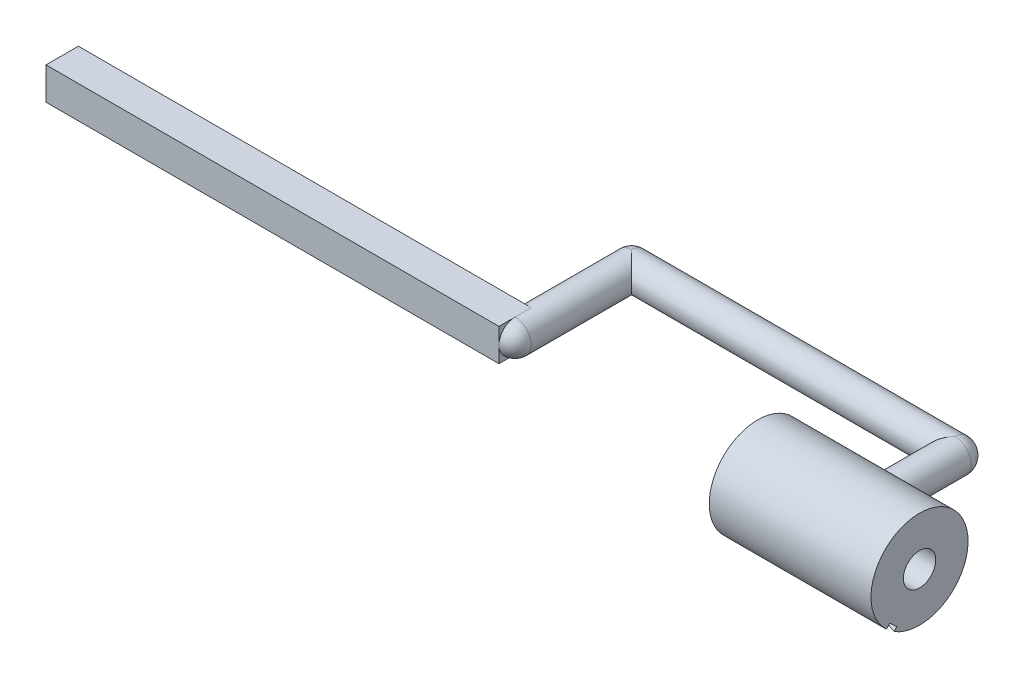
ISO-10303-21;
HEADER;
FILE_DESCRIPTION(('STEP AP214'),'2;1');
FILE_NAME('part.step','',(''),(''),'','','');
FILE_SCHEMA(('AUTOMOTIVE_DESIGN { 1 0 10303 214 1 1 1 1 }'));
ENDSEC;
DATA;
#1=APPLICATION_CONTEXT('core data for automotive mechanical design processes');
#2=APPLICATION_PROTOCOL_DEFINITION('international standard','automotive_design',2000,#1);
#3=PRODUCT_CONTEXT('',#1,'mechanical');
#4=PRODUCT('Part','Part','',(#3));
#5=PRODUCT_RELATED_PRODUCT_CATEGORY('part','',(#4));
#6=PRODUCT_DEFINITION_FORMATION('','',#4);
#7=PRODUCT_DEFINITION_CONTEXT('part definition',#1,'design');
#8=PRODUCT_DEFINITION('design','',#6,#7);
#9=PRODUCT_DEFINITION_SHAPE('','',#8);
#10=(LENGTH_UNIT() NAMED_UNIT(*) SI_UNIT(.MILLI.,.METRE.));
#11=(NAMED_UNIT(*) PLANE_ANGLE_UNIT() SI_UNIT($,.RADIAN.));
#12=(NAMED_UNIT(*) SI_UNIT($,.STERADIAN.) SOLID_ANGLE_UNIT());
#13=UNCERTAINTY_MEASURE_WITH_UNIT(LENGTH_MEASURE(1.E-05),#10,'distance_accuracy_value','');
#14=(GEOMETRIC_REPRESENTATION_CONTEXT(3) GLOBAL_UNCERTAINTY_ASSIGNED_CONTEXT((#13)) GLOBAL_UNIT_ASSIGNED_CONTEXT((#10,
#11,#12)) REPRESENTATION_CONTEXT('',''));
#15=CARTESIAN_POINT('',(0.,0.,0.));
#16=DIRECTION('',(0.,0.,1.));
#17=DIRECTION('',(1.,0.,0.));
#18=AXIS2_PLACEMENT_3D('',#15,#16,#17);
#19=CARTESIAN_POINT('',(12.5,0.,18.));
#20=DIRECTION('',(-1.,0.,0.));
#21=DIRECTION('',(0.,0.,1.));
#22=AXIS2_PLACEMENT_3D('',#19,#20,#21);
#23=CYLINDRICAL_SURFACE('',#22,7.5);
#24=CARTESIAN_POINT('',(-2.5,0.,10.5));
#25=CARTESIAN_POINT('',(-2.5000006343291,-0.136408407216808,10.4999996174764));
#26=CARTESIAN_POINT('',(-2.48879933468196,-0.272812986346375,10.5037557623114));
#27=CARTESIAN_POINT('',(-2.44442722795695,-0.541604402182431,10.518369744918));
#28=CARTESIAN_POINT('',(-2.41125414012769,-0.673990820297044,10.5292283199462));
#29=CARTESIAN_POINT('',(-2.32420189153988,-0.93083197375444,10.5568673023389));
#30=CARTESIAN_POINT('',(-2.27035734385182,-1.05529956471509,10.5736378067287));
#31=CARTESIAN_POINT('',(-2.14364706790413,-1.29343734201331,10.6113888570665));
#32=CARTESIAN_POINT('',(-2.0707775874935,-1.40710539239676,10.6323702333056));
#33=CARTESIAN_POINT('',(-1.90543548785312,-1.62435418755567,10.6771476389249));
#34=CARTESIAN_POINT('',(-1.81242191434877,-1.72750925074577,10.7010110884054));
#35=CARTESIAN_POINT('',(-1.61058211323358,-1.91708173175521,10.748492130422));
#36=CARTESIAN_POINT('',(-1.50175241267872,-2.00349546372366,10.7721096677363));
#37=CARTESIAN_POINT('',(-1.26753721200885,-2.15956235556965,10.8171666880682));
#38=CARTESIAN_POINT('',(-1.14176565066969,-2.22866214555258,10.8385240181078));
#39=CARTESIAN_POINT('',(-0.879559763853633,-2.3445471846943,10.875617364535));
#40=CARTESIAN_POINT('',(-0.74312870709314,-2.39133924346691,10.8913550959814));
#41=CARTESIAN_POINT('',(-0.468316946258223,-2.45968365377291,10.9147174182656));
#42=CARTESIAN_POINT('',(-0.330156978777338,-2.48203362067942,10.9225976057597));
#43=CARTESIAN_POINT('',(-0.0518406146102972,-2.50335280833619,10.9301085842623));
#44=CARTESIAN_POINT('',(0.0883151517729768,-2.5023292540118,10.9297419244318));
#45=CARTESIAN_POINT('',(0.359841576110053,-2.47754975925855,10.9210246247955));
#46=CARTESIAN_POINT('',(0.491321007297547,-2.45483478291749,10.9130396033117));
#47=CARTESIAN_POINT('',(0.748483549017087,-2.38901540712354,10.8905835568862));
#48=CARTESIAN_POINT('',(0.874165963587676,-2.34590856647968,10.8761117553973));
#49=CARTESIAN_POINT('',(1.1185318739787,-2.23984764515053,10.8420522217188));
#50=CARTESIAN_POINT('',(1.23707006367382,-2.17658512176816,10.8223858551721));
#51=CARTESIAN_POINT('',(1.46217727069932,-2.03222276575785,10.7801860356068));
#52=CARTESIAN_POINT('',(1.56874281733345,-1.95111778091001,10.7576517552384));
#53=CARTESIAN_POINT('',(1.77272899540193,-1.76837333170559,10.7108167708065));
#54=CARTESIAN_POINT('',(1.86938173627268,-1.66588287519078,10.6864852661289));
#55=CARTESIAN_POINT('',(2.0443281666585,-1.44584892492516,10.6398265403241));
#56=CARTESIAN_POINT('',(2.12262009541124,-1.32830398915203,10.6174995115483));
#57=CARTESIAN_POINT('',(2.25924075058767,-1.07986903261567,10.5770723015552));
#58=CARTESIAN_POINT('',(2.31736372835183,-0.94885819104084,10.559016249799));
#59=CARTESIAN_POINT('',(2.41050793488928,-0.678172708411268,10.5294858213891));
#60=CARTESIAN_POINT('',(2.44553718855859,-0.538501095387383,10.518009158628));
#61=CARTESIAN_POINT('',(2.4901391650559,-0.260959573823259,10.503309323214));
#62=CARTESIAN_POINT('',(2.50074952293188,-0.123273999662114,10.4997499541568));
#63=CARTESIAN_POINT('',(2.49916831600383,0.151937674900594,10.5002774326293));
#64=CARTESIAN_POINT('',(2.48698060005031,0.289463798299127,10.5043629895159));
#65=CARTESIAN_POINT('',(2.4409702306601,0.55629966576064,10.5194993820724));
#66=CARTESIAN_POINT('',(2.40778448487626,0.68573201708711,10.5303450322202));
#67=CARTESIAN_POINT('',(2.32151638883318,0.937139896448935,10.5577038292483));
#68=CARTESIAN_POINT('',(2.26843150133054,1.05911447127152,10.5742176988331));
#69=CARTESIAN_POINT('',(2.14232392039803,1.29572074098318,10.6117767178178));
#70=CARTESIAN_POINT('',(2.06881351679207,1.41007489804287,10.6329296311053));
#71=CARTESIAN_POINT('',(1.90451462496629,1.62516207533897,10.6773686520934));
#72=CARTESIAN_POINT('',(1.81372085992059,1.72589091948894,10.7006554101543));
#73=CARTESIAN_POINT('',(1.61255312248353,1.91563126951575,10.7480788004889));
#74=CARTESIAN_POINT('',(1.50147693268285,2.00390242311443,10.7722059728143));
#75=CARTESIAN_POINT('',(1.26557108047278,2.16064380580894,10.8175006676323));
#76=CARTESIAN_POINT('',(1.14074130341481,2.22911386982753,10.8386681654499));
#77=CARTESIAN_POINT('',(0.880817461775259,2.3439923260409,10.8754402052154));
#78=CARTESIAN_POINT('',(0.745744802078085,2.39044533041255,10.8910559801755));
#79=CARTESIAN_POINT('',(0.469053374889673,2.45973666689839,10.9147291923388));
#80=CARTESIAN_POINT('',(0.327437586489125,2.48258563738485,10.922790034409));
#81=CARTESIAN_POINT('',(0.0495072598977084,2.50319070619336,10.9300535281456));
#82=CARTESIAN_POINT('',(-0.0867058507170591,2.502175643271,10.9296899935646));
#83=CARTESIAN_POINT('',(-0.356912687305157,2.47810573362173,10.9212182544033));
#84=CARTESIAN_POINT('',(-0.490906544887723,2.45505219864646,10.913110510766));
#85=CARTESIAN_POINT('',(-0.750339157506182,2.38842953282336,10.8903868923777));
#86=CARTESIAN_POINT('',(-0.875892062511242,2.34525836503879,10.8758975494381));
#87=CARTESIAN_POINT('',(-1.11806851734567,2.23994841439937,10.8420900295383));
#88=CARTESIAN_POINT('',(-1.23469007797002,2.17780542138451,10.8227707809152));
#89=CARTESIAN_POINT('',(-1.46120917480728,2.03315173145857,10.7804292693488));
#90=CARTESIAN_POINT('',(-1.57059125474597,1.94987060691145,10.7572822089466));
#91=CARTESIAN_POINT('',(-1.7742245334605,1.76660720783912,10.7104160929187));
#92=CARTESIAN_POINT('',(-1.86847143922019,1.6666202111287,10.6866968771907));
#93=CARTESIAN_POINT('',(-2.04286103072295,1.44810389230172,10.6402492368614));
#94=CARTESIAN_POINT('',(-2.1223108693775,1.32900378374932,10.6175954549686));
#95=CARTESIAN_POINT('',(-2.25997607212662,1.07839339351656,10.5768502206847));
#96=CARTESIAN_POINT('',(-2.31819686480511,0.94688629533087,10.5587576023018));
#97=CARTESIAN_POINT('',(-2.40930408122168,0.681234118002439,10.5298621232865));
#98=CARTESIAN_POINT('',(-2.44320616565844,0.547469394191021,10.5187696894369));
#99=CARTESIAN_POINT('',(-2.48855070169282,0.275801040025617,10.5038398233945));
#100=CARTESIAN_POINT('',(-2.49999935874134,0.137898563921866,10.5000003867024));
#101=CARTESIAN_POINT('',(-2.5,0.,10.5));
#102=B_SPLINE_CURVE_WITH_KNOTS('',3,(#24,#25,#26,#27,#28,#29,#30,#31,#32,#33,#34,#35,#36,#37,
#38,#39,#40,#41,#42,#43,#44,#45,#46,#47,#48,#49,#50,#51,#52,#53,#54,#55,#56,#57,#58,#59,#60,#61,
#62,#63,#64,#65,#66,#67,#68,#69,#70,#71,#72,#73,#74,#75,#76,#77,#78,#79,#80,#81,#82,#83,#84,#85,
#86,#87,#88,#89,#90,#91,#92,#93,#94,#95,#96,#97,#98,#99,#100,#101),.UNSPECIFIED.,.T.,.F.,(4,2,2,
2,2,2,2,2,2,2,2,2,2,2,2,2,2,2,2,2,2,2,2,2,2,2,2,2,2,2,2,2,2,2,2,2,2,2,4),(0.,0.408717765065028,
0.817477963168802,1.22555668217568,1.63371594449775,2.0546171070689,2.47561083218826,
2.90870962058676,3.34167611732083,3.760048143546,4.17829084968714,4.57742066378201,
4.97659827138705,5.38220427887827,5.78792756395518,6.21483264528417,6.64177864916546,
7.07296014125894,7.50399172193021,7.91633957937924,8.32861782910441,8.72895394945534,
9.1293411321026,9.54025999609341,9.95130452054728,10.3810255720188,10.8107502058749,
11.2396003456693,11.668257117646,12.0748916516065,12.4815019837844,12.8803896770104,
13.2793659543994,13.6957516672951,14.1122552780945,14.5449915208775,14.9776170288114,
15.3909139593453,15.8040966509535),.UNSPECIFIED.);
#103=CARTESIAN_POINT('',(-2.5,0.,10.5));
#104=VERTEX_POINT('',#103);
#105=EDGE_CURVE('E145',#104,#104,#102,.T.);
#106=ORIENTED_EDGE('',*,*,#105,.T.);
#107=EDGE_LOOP('',(#106));
#108=FACE_BOUND('',#107,.T.);
#109=CARTESIAN_POINT('',(12.5,-5.48515276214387,23.1149877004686));
#110=CARTESIAN_POINT('',(9.67857142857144,-6.65261532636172,21.8630373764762));
#111=CARTESIAN_POINT('',(6.85714285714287,-7.16126186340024,20.228526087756));
#112=CARTESIAN_POINT('',(4.03571428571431,-7.66990840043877,18.5940147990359));
#113=CARTESIAN_POINT('',(1.21428571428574,-7.4189952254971,16.9006775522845));
#114=CARTESIAN_POINT('',(-1.60714285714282,-7.16808205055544,15.2073403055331));
#115=CARTESIAN_POINT('',(-4.42857142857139,-6.20730559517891,13.7905633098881));
#116=CARTESIAN_POINT('',(-7.24999999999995,-5.24652913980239,12.373786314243));
#117=CARTESIAN_POINT('',(-10.0714285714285,-3.76618296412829,11.5141796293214));
#118=CARTESIAN_POINT('',(-12.8928571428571,-2.28583678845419,10.6545729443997));
#119=CARTESIAN_POINT('',(-15.7142857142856,-0.579121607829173,10.5223922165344));
#120=CARTESIAN_POINT('',(-18.5357142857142,1.12759357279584,10.3902114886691));
#121=CARTESIAN_POINT('',(-21.3571428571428,2.72264188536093,11.011636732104));
#122=CARTESIAN_POINT('',(-24.1785714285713,4.31769019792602,11.6330619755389));
#123=CARTESIAN_POINT('',(-26.9999999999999,5.48515276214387,12.8850122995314));
#124=CARTESIAN_POINT('',(-29.8214285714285,6.65261532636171,14.1369626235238));
#125=CARTESIAN_POINT('',(-32.642857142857,7.16126186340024,15.771473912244));
#126=(BOUNDED_CURVE() B_SPLINE_CURVE(2,(#109,#110,#111,#112,#113,#114,#115,#116,#117,#118,#119,
#120,#121,#122,#123,#124,#125),.UNSPECIFIED.,.F.,.F.) B_SPLINE_CURVE_WITH_KNOTS((3,2,2,2,2,2,2,
2,3),(0.,0.125,0.25,0.375,0.5,0.625,0.75,0.875,1.),
.UNSPECIFIED.) CURVE() GEOMETRIC_REPRESENTATION_ITEM() RATIONAL_B_SPLINE_CURVE((1.,
0.974927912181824,1.,0.974927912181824,1.,0.974927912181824,1.,0.974927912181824,1.,
0.974927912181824,1.,0.974927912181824,1.,0.974927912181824,1.,0.974927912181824,1.)) REPRESENTATION_ITEM(''));
#127=CARTESIAN_POINT('',(12.5,-5.48515276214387,23.1149877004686));
#128=VERTEX_POINT('',#127);
#129=CARTESIAN_POINT('',(-12.5000173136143,-2.44928880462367,10.9112071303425));
#130=VERTEX_POINT('',#129);
#131=EDGE_CURVE('E52',#128,#130,#126,.T.);
#132=ORIENTED_EDGE('',*,*,#131,.F.);
#133=CARTESIAN_POINT('',(12.5,0.,18.));
#134=DIRECTION('',(1.,0.,0.));
#135=DIRECTION('',(0.,0.,-1.));
#136=AXIS2_PLACEMENT_3D('',#133,#134,#135);
#137=CIRCLE('',#136,7.5);
#138=CARTESIAN_POINT('',(12.5,-6.38825116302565,21.9294079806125));
#139=VERTEX_POINT('',#138);
#140=EDGE_CURVE('E135',#139,#128,#137,.T.);
#141=ORIENTED_EDGE('',*,*,#140,.F.);
#142=CARTESIAN_POINT('',(12.5,-6.38825116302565,21.9294079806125));
#143=CARTESIAN_POINT('',(9.67857142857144,-7.28511289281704,20.4713313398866));
#144=CARTESIAN_POINT('',(6.85714285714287,-7.46052164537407,18.7685159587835));
#145=CARTESIAN_POINT('',(4.03571428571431,-7.6359303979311,17.0657005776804));
#146=CARTESIAN_POINT('',(1.21428571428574,-7.05514431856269,15.4554099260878));
#147=CARTESIAN_POINT('',(-1.60714285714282,-6.47435823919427,13.8451192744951));
#148=CARTESIAN_POINT('',(-4.42857142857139,-5.25240913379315,12.6462911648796));
#149=CARTESIAN_POINT('',(-7.24999999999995,-4.03046002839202,11.4474630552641));
#150=CARTESIAN_POINT('',(-10.0714285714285,-2.40936990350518,10.897540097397));
#151=CARTESIAN_POINT('',(-12.8928571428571,-0.78827977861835,10.3476171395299));
#152=CARTESIAN_POINT('',(-15.7142857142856,0.91087458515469,10.5555183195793));
#153=CARTESIAN_POINT('',(-18.5357142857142,2.61002894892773,10.7634194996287));
#154=CARTESIAN_POINT('',(-21.3571428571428,4.050709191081,11.6879674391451));
#155=CARTESIAN_POINT('',(-24.1785714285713,5.49138943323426,12.6125153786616));
#156=CARTESIAN_POINT('',(-26.9999999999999,6.38825116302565,14.0705920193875));
#157=CARTESIAN_POINT('',(-29.8214285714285,7.28511289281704,15.5286686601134));
#158=CARTESIAN_POINT('',(-32.642857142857,7.46052164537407,17.2314840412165));
#159=(BOUNDED_CURVE() B_SPLINE_CURVE(2,(#142,#143,#144,#145,#146,#147,#148,#149,#150,#151,#152,
#153,#154,#155,#156,#157,#158),.UNSPECIFIED.,.F.,.F.) B_SPLINE_CURVE_WITH_KNOTS((3,2,2,2,2,2,2,
2,3),(0.,0.125,0.25,0.375,0.5,0.625,0.75,0.875,1.),
.UNSPECIFIED.) CURVE() GEOMETRIC_REPRESENTATION_ITEM() RATIONAL_B_SPLINE_CURVE((1.,
0.974927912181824,1.,0.974927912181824,1.,0.974927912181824,1.,0.974927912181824,1.,
0.974927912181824,1.,0.974927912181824,1.,0.974927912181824,1.,0.974927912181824,1.)) REPRESENTATION_ITEM(''));
#160=CARTESIAN_POINT('',(-12.5000000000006,-0.999303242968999,10.5668719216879));
#161=VERTEX_POINT('',#160);
#162=EDGE_CURVE('E138',#139,#161,#159,.T.);
#163=ORIENTED_EDGE('',*,*,#162,.T.);
#164=CARTESIAN_POINT('',(-12.5,0.,18.));
#165=DIRECTION('',(1.,0.,0.));
#166=DIRECTION('',(0.,0.,-1.));
#167=AXIS2_PLACEMENT_3D('',#164,#165,#166);
#168=CIRCLE('',#167,7.5);
#169=EDGE_CURVE('E137',#161,#130,#168,.T.);
#170=ORIENTED_EDGE('',*,*,#169,.T.);
#171=EDGE_LOOP('',(#132,#141,#163,#170));
#172=FACE_BOUND('',#171,.T.);
#173=ADVANCED_FACE('F32',(#108,#172),#23,.T.);
#174=CARTESIAN_POINT('',(-12.5,0.,18.));
#175=DIRECTION('',(1.,0.,0.));
#176=DIRECTION('',(0.,0.,-1.));
#177=AXIS2_PLACEMENT_3D('',#174,#175,#176);
#178=PLANE('',#177);
#179=CARTESIAN_POINT('',(-12.5,0.,18.));
#180=DIRECTION('',(1.,0.,0.));
#181=DIRECTION('',(0.,0.,-1.));
#182=AXIS2_PLACEMENT_3D('',#179,#180,#181);
#183=CIRCLE('',#182,2.5);
#184=CARTESIAN_POINT('',(-12.5,0.,15.5));
#185=VERTEX_POINT('',#184);
#186=EDGE_CURVE('E177',#185,#185,#183,.F.);
#187=ORIENTED_EDGE('',*,*,#186,.F.);
#188=EDGE_LOOP('',(#187));
#189=FACE_BOUND('',#188,.T.);
#190=CARTESIAN_POINT('',(-12.5,-0.799127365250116,11.1462123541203));
#191=CARTESIAN_POINT('',(-12.5,-0.816237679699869,11.0966924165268));
#192=CARTESIAN_POINT('',(-12.5,-0.833347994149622,11.0471724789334));
#193=CARTESIAN_POINT('',(-12.5,-0.867568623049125,10.9481326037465));
#194=CARTESIAN_POINT('',(-12.5,-0.884678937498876,10.898612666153));
#195=CARTESIAN_POINT('',(-12.5,-0.934293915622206,10.755019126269));
#196=CARTESIAN_POINT('',(-12.5,-0.966798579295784,10.6609455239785));
#197=CARTESIAN_POINT('',(-12.5,-0.999303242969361,10.566871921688));
#198=B_SPLINE_CURVE_WITH_KNOTS('',3,(#190,#191,#192,#193,#194,#195,#196,#197),.UNSPECIFIED.,.F.,
.F.,(4,2,2,4),(0.,0.157177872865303,0.314355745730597,0.612948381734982),.UNSPECIFIED.);
#199=CARTESIAN_POINT('',(-12.5,-0.799127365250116,11.1462123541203));
#200=VERTEX_POINT('',#199);
#201=EDGE_CURVE('E11',#200,#161,#198,.T.);
#202=ORIENTED_EDGE('',*,*,#201,.F.);
#203=CARTESIAN_POINT('',(-12.5,-2.20080480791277,11.6305251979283));
#204=CARTESIAN_POINT('',(-12.5,-2.08099445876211,11.5891278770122));
#205=CARTESIAN_POINT('',(-12.5,-1.96118410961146,11.5477305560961));
#206=CARTESIAN_POINT('',(-12.5,-1.72156341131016,11.4649359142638));
#207=CARTESIAN_POINT('',(-12.5,-1.6017530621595,11.4235385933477));
#208=CARTESIAN_POINT('',(-12.5,-1.25433759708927,11.3034982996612));
#209=CARTESIAN_POINT('',(-12.5,-1.0267324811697,11.2248553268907));
#210=CARTESIAN_POINT('',(-12.5,-0.79912736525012,11.1462123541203));
#211=B_SPLINE_CURVE_WITH_KNOTS('',3,(#203,#204,#205,#206,#207,#208,#209,#210),.UNSPECIFIED.,.F.,
.F.,(4,2,2,4),(0.,0.380281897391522,0.760563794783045,1.48298974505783),.UNSPECIFIED.);
#212=CARTESIAN_POINT('',(-12.5,-2.20080480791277,11.6305251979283));
#213=VERTEX_POINT('',#212);
#214=EDGE_CURVE('E44',#213,#200,#211,.T.);
#215=ORIENTED_EDGE('',*,*,#214,.F.);
#216=CARTESIAN_POINT('',(-12.5,-2.44934015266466,10.9112248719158));
#217=CARTESIAN_POINT('',(-12.5,-2.42809624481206,10.9727080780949));
#218=CARTESIAN_POINT('',(-12.5,-2.40685233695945,11.0341912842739));
#219=CARTESIAN_POINT('',(-12.5,-2.36436452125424,11.157157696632));
#220=CARTESIAN_POINT('',(-12.5,-2.34312061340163,11.218640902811));
#221=CARTESIAN_POINT('',(-12.5,-2.28151940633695,11.3969244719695));
#222=CARTESIAN_POINT('',(-12.5,-2.24116210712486,11.5137248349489));
#223=CARTESIAN_POINT('',(-12.5,-2.20080480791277,11.6305251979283));
#224=B_SPLINE_CURVE_WITH_KNOTS('',3,(#216,#217,#218,#219,#220,#221,#222,#223),.UNSPECIFIED.,.F.,
.F.,(4,2,2,4),(0.,0.195149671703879,0.390299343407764,0.761027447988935),.UNSPECIFIED.);
#225=EDGE_CURVE('E263',#130,#213,#224,.T.);
#226=ORIENTED_EDGE('',*,*,#225,.F.);
#227=ORIENTED_EDGE('',*,*,#169,.F.);
#228=EDGE_LOOP('',(#202,#215,#226,#227));
#229=FACE_BOUND('',#228,.T.);
#230=ADVANCED_FACE('F237',(#189,#229),#178,.F.);
#231=CARTESIAN_POINT('',(-50.,-2.5,15.5));
#232=DIRECTION('',(-1.,0.,0.));
#233=DIRECTION('',(0.,0.,1.));
#234=AXIS2_PLACEMENT_3D('',#231,#232,#233);
#235=PLANE('',#234);
#236=CARTESIAN_POINT('',(-50.,0.,18.));
#237=DIRECTION('',(-1.,0.,0.));
#238=DIRECTION('',(0.,0.,1.));
#239=AXIS2_PLACEMENT_3D('',#236,#237,#238);
#240=CIRCLE('',#239,2.5);
#241=CARTESIAN_POINT('',(-50.,0.,20.5));
#242=VERTEX_POINT('',#241);
#243=CARTESIAN_POINT('',(-50.,-2.5,18.));
#244=VERTEX_POINT('',#243);
#245=EDGE_CURVE('E351',#242,#244,#240,.F.);
#246=ORIENTED_EDGE('',*,*,#245,.F.);
#247=DIRECTION('',(0.,1.,0.));
#248=VECTOR('',#247,1.);
#249=CARTESIAN_POINT('',(-50.,2.5,20.5));
#250=LINE('',#249,#248);
#251=CARTESIAN_POINT('',(-50.,-2.5,20.5));
#252=VERTEX_POINT('',#251);
#253=EDGE_CURVE('E185',#252,#242,#250,.T.);
#254=ORIENTED_EDGE('',*,*,#253,.F.);
#255=DIRECTION('',(0.,0.,1.));
#256=VECTOR('',#255,1.);
#257=CARTESIAN_POINT('',(-50.,-2.5,15.5));
#258=LINE('',#257,#256);
#259=EDGE_CURVE('E180',#244,#252,#258,.T.);
#260=ORIENTED_EDGE('',*,*,#259,.F.);
#261=EDGE_LOOP('',(#246,#254,#260));
#262=FACE_BOUND('',#261,.T.);
#263=ADVANCED_FACE('F245',(#262),#235,.F.);
#264=CARTESIAN_POINT('',(-50.,2.5,18.));
#265=VERTEX_POINT('',#264);
#266=EDGE_CURVE('E349',#265,#242,#240,.F.);
#267=ORIENTED_EDGE('',*,*,#266,.F.);
#268=DIRECTION('',(0.,0.,-1.));
#269=VECTOR('',#268,1.);
#270=CARTESIAN_POINT('',(-50.,2.5,15.5));
#271=LINE('',#270,#269);
#272=CARTESIAN_POINT('',(-50.,2.5,20.5));
#273=VERTEX_POINT('',#272);
#274=EDGE_CURVE('E188',#273,#265,#271,.T.);
#275=ORIENTED_EDGE('',*,*,#274,.F.);
#276=EDGE_CURVE('E184',#242,#273,#250,.T.);
#277=ORIENTED_EDGE('',*,*,#276,.F.);
#278=EDGE_LOOP('',(#267,#275,#277));
#279=FACE_BOUND('',#278,.T.);
#280=ADVANCED_FACE('F314',(#279),#235,.F.);
#281=CARTESIAN_POINT('',(-50.,0.,18.));
#282=DIRECTION('',(0.,0.,-1.));
#283=DIRECTION('',(-1.,0.,0.));
#284=AXIS2_PLACEMENT_3D('',#281,#282,#283);
#285=CYLINDRICAL_SURFACE('',#284,2.5);
#286=CARTESIAN_POINT('',(-50.,0.,0.));
#287=DIRECTION('',(0.707106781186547,0.,-0.707106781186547));
#288=DIRECTION('',(0.707106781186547,0.,0.707106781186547));
#289=AXIS2_PLACEMENT_3D('',#286,#287,#288);
#290=ELLIPSE('',#289,3.53553390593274,2.5);
#291=CARTESIAN_POINT('',(-50.,2.5,0.));
#292=VERTEX_POINT('',#291);
#293=CARTESIAN_POINT('',(-50.,-2.5,0.));
#294=VERTEX_POINT('',#293);
#295=EDGE_CURVE('E217',#292,#294,#290,.T.);
#296=ORIENTED_EDGE('',*,*,#295,.F.);
#297=CARTESIAN_POINT('',(-50.,0.,0.));
#298=DIRECTION('',(0.,0.,1.));
#299=DIRECTION('',(1.,0.,0.));
#300=AXIS2_PLACEMENT_3D('',#297,#298,#299);
#301=CIRCLE('',#300,2.5);
#302=EDGE_CURVE('E211',#292,#294,#301,.T.);
#303=ORIENTED_EDGE('',*,*,#302,.T.);
#304=EDGE_LOOP('',(#296,#303));
#305=FACE_BOUND('',#304,.T.);
#306=CARTESIAN_POINT('',(-50.,2.5,15.5));
#307=VERTEX_POINT('',#306);
#308=EDGE_CURVE('E187',#265,#307,#271,.T.);
#309=ORIENTED_EDGE('',*,*,#308,.F.);
#310=CARTESIAN_POINT('',(-50.,0.,18.));
#311=DIRECTION('',(0.,0.,1.));
#312=DIRECTION('',(1.,0.,0.));
#313=AXIS2_PLACEMENT_3D('',#310,#311,#312);
#314=CIRCLE('',#313,2.5);
#315=EDGE_CURVE('E214',#244,#265,#314,.T.);
#316=ORIENTED_EDGE('',*,*,#315,.F.);
#317=CARTESIAN_POINT('',(-50.,-2.5,15.5));
#318=VERTEX_POINT('',#317);
#319=EDGE_CURVE('E60',#318,#244,#258,.T.);
#320=ORIENTED_EDGE('',*,*,#319,.F.);
#321=CARTESIAN_POINT('',(-50.,0.,15.5));
#322=DIRECTION('',(0.,0.,1.));
#323=DIRECTION('',(1.,0.,0.));
#324=AXIS2_PLACEMENT_3D('',#321,#322,#323);
#325=CIRCLE('',#324,2.5);
#326=EDGE_CURVE('E232',#307,#318,#325,.T.);
#327=ORIENTED_EDGE('',*,*,#326,.F.);
#328=EDGE_LOOP('',(#309,#316,#320,#327));
#329=FACE_BOUND('',#328,.T.);
#330=ADVANCED_FACE('F332',(#305,#329),#285,.T.);
#331=CARTESIAN_POINT('',(-50.,0.,0.));
#332=DIRECTION('',(1.,0.,0.));
#333=DIRECTION('',(0.,0.,-1.));
#334=AXIS2_PLACEMENT_3D('',#331,#332,#333);
#335=CYLINDRICAL_SURFACE('',#334,2.5);
#336=CARTESIAN_POINT('',(0.,0.,0.));
#337=DIRECTION('',(-0.707106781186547,0.,-0.707106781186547));
#338=DIRECTION('',(0.707106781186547,0.,-0.707106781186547));
#339=AXIS2_PLACEMENT_3D('',#336,#337,#338);
#340=ELLIPSE('',#339,3.53553390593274,2.5);
#341=CARTESIAN_POINT('',(0.,2.5,0.));
#342=VERTEX_POINT('',#341);
#343=CARTESIAN_POINT('',(0.,-2.5,0.));
#344=VERTEX_POINT('',#343);
#345=EDGE_CURVE('E147',#342,#344,#340,.F.);
#346=ORIENTED_EDGE('',*,*,#345,.F.);
#347=CARTESIAN_POINT('',(0.,0.,0.));
#348=DIRECTION('',(1.,0.,0.));
#349=DIRECTION('',(0.,0.,-1.));
#350=AXIS2_PLACEMENT_3D('',#347,#348,#349);
#351=CIRCLE('',#350,2.5);
#352=EDGE_CURVE('E220',#344,#342,#351,.T.);
#353=ORIENTED_EDGE('',*,*,#352,.F.);
#354=EDGE_LOOP('',(#346,#353));
#355=FACE_BOUND('',#354,.T.);
#356=CARTESIAN_POINT('',(-50.,0.,0.));
#357=DIRECTION('',(1.,0.,0.));
#358=DIRECTION('',(0.,0.,-1.));
#359=AXIS2_PLACEMENT_3D('',#356,#357,#358);
#360=CIRCLE('',#359,2.5);
#361=EDGE_CURVE('E223',#294,#292,#360,.T.);
#362=ORIENTED_EDGE('',*,*,#361,.T.);
#363=ORIENTED_EDGE('',*,*,#295,.T.);
#364=EDGE_LOOP('',(#362,#363));
#365=FACE_BOUND('',#364,.T.);
#366=ADVANCED_FACE('F247',(#355,#365),#335,.T.);
#367=CARTESIAN_POINT('',(0.,0.,18.));
#368=DIRECTION('',(0.,0.,-1.));
#369=DIRECTION('',(-1.,0.,0.));
#370=AXIS2_PLACEMENT_3D('',#367,#368,#369);
#371=CYLINDRICAL_SURFACE('',#370,2.5);
#372=CARTESIAN_POINT('',(0.,0.,0.));
#373=DIRECTION('',(0.,0.,1.));
#374=DIRECTION('',(1.,0.,0.));
#375=AXIS2_PLACEMENT_3D('',#372,#373,#374);
#376=CIRCLE('',#375,2.5);
#377=EDGE_CURVE('E143',#344,#342,#376,.T.);
#378=ORIENTED_EDGE('',*,*,#377,.T.);
#379=ORIENTED_EDGE('',*,*,#345,.T.);
#380=EDGE_LOOP('',(#378,#379));
#381=FACE_BOUND('',#380,.T.);
#382=ORIENTED_EDGE('',*,*,#105,.F.);
#383=EDGE_LOOP('',(#382));
#384=FACE_BOUND('',#383,.T.);
#385=ADVANCED_FACE('F34',(#381,#384),#371,.T.);
#386=CARTESIAN_POINT('',(12.5,0.,18.));
#387=DIRECTION('',(1.,0.,0.));
#388=DIRECTION('',(0.,0.,-1.));
#389=AXIS2_PLACEMENT_3D('',#386,#387,#388);
#390=PLANE('',#389);
#391=DIRECTION('',(0.,-0.731353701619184,0.681998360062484));
#392=VECTOR('',#391,1.);
#393=CARTESIAN_POINT('',(12.5,-5.48515276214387,23.1149877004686));
#394=LINE('',#393,#392);
#395=CARTESIAN_POINT('',(12.5,-4.92857252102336,22.5959682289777));
#396=VERTEX_POINT('',#395);
#397=EDGE_CURVE('E122',#396,#128,#394,.T.);
#398=ORIENTED_EDGE('',*,*,#397,.F.);
#399=DIRECTION('',(0.,0.681998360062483,0.731353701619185));
#400=VECTOR('',#399,1.);
#401=CARTESIAN_POINT('',(12.5,-4.92857252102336,22.5959682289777));
#402=LINE('',#401,#400);
#403=CARTESIAN_POINT('',(12.5,-5.93996909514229,21.5113781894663));
#404=VERTEX_POINT('',#403);
#405=EDGE_CURVE('E129',#404,#396,#402,.T.);
#406=ORIENTED_EDGE('',*,*,#405,.F.);
#407=DIRECTION('',(0.,0.731353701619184,-0.681998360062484));
#408=VECTOR('',#407,1.);
#409=CARTESIAN_POINT('',(12.5,-5.93996909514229,21.5113781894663));
#410=LINE('',#409,#408);
#411=EDGE_CURVE('E142',#139,#404,#410,.T.);
#412=ORIENTED_EDGE('',*,*,#411,.F.);
#413=ORIENTED_EDGE('',*,*,#140,.T.);
#414=EDGE_LOOP('',(#398,#406,#412,#413));
#415=FACE_BOUND('',#414,.T.);
#416=CARTESIAN_POINT('',(12.5,0.,18.));
#417=DIRECTION('',(1.,0.,0.));
#418=DIRECTION('',(0.,0.,-1.));
#419=AXIS2_PLACEMENT_3D('',#416,#417,#418);
#420=CIRCLE('',#419,2.5);
#421=CARTESIAN_POINT('',(12.5,0.,15.5));
#422=VERTEX_POINT('',#421);
#423=EDGE_CURVE('E169',#422,#422,#420,.T.);
#424=ORIENTED_EDGE('',*,*,#423,.F.);
#425=EDGE_LOOP('',(#424));
#426=FACE_BOUND('',#425,.T.);
#427=ADVANCED_FACE('F140',(#415,#426),#390,.T.);
#428=CARTESIAN_POINT('',(-120.,2.5,15.5));
#429=DIRECTION('',(0.,0.,1.));
#430=DIRECTION('',(1.,0.,0.));
#431=AXIS2_PLACEMENT_3D('',#428,#429,#430);
#432=PLANE('',#431);
#433=DIRECTION('',(1.,0.,0.));
#434=VECTOR('',#433,1.);
#435=CARTESIAN_POINT('',(-120.,2.5,15.5));
#436=LINE('',#435,#434);
#437=CARTESIAN_POINT('',(-120.,2.5,15.5));
#438=VERTEX_POINT('',#437);
#439=EDGE_CURVE('E200',#438,#307,#436,.T.);
#440=ORIENTED_EDGE('',*,*,#439,.T.);
#441=ORIENTED_EDGE('',*,*,#326,.T.);
#442=DIRECTION('',(1.,0.,0.));
#443=VECTOR('',#442,1.);
#444=CARTESIAN_POINT('',(-120.,-2.5,15.5));
#445=LINE('',#444,#443);
#446=CARTESIAN_POINT('',(-120.,-2.5,15.5));
#447=VERTEX_POINT('',#446);
#448=EDGE_CURVE('E209',#447,#318,#445,.T.);
#449=ORIENTED_EDGE('',*,*,#448,.F.);
#450=DIRECTION('',(0.,-1.,0.));
#451=VECTOR('',#450,1.);
#452=CARTESIAN_POINT('',(-120.,2.5,15.5));
#453=LINE('',#452,#451);
#454=EDGE_CURVE('E191',#438,#447,#453,.T.);
#455=ORIENTED_EDGE('',*,*,#454,.F.);
#456=EDGE_LOOP('',(#440,#441,#449,#455));
#457=FACE_BOUND('',#456,.T.);
#458=ADVANCED_FACE('F241',(#457),#432,.F.);
#459=CARTESIAN_POINT('',(-120.,-2.5,15.5));
#460=DIRECTION('',(0.,1.,0.));
#461=DIRECTION('',(0.,0.,1.));
#462=AXIS2_PLACEMENT_3D('',#459,#460,#461);
#463=PLANE('',#462);
#464=ORIENTED_EDGE('',*,*,#319,.T.);
#465=ORIENTED_EDGE('',*,*,#259,.T.);
#466=DIRECTION('',(1.,0.,0.));
#467=VECTOR('',#466,1.);
#468=CARTESIAN_POINT('',(-120.,-2.5,20.5));
#469=LINE('',#468,#467);
#470=CARTESIAN_POINT('',(-120.,-2.5,20.5));
#471=VERTEX_POINT('',#470);
#472=EDGE_CURVE('E206',#471,#252,#469,.T.);
#473=ORIENTED_EDGE('',*,*,#472,.F.);
#474=DIRECTION('',(0.,0.,1.));
#475=VECTOR('',#474,1.);
#476=CARTESIAN_POINT('',(-120.,-2.5,15.5));
#477=LINE('',#476,#475);
#478=EDGE_CURVE('E194',#447,#471,#477,.T.);
#479=ORIENTED_EDGE('',*,*,#478,.F.);
#480=ORIENTED_EDGE('',*,*,#448,.T.);
#481=EDGE_LOOP('',(#464,#465,#473,#479,#480));
#482=FACE_BOUND('',#481,.T.);
#483=ADVANCED_FACE('F326',(#482),#463,.F.);
#484=CARTESIAN_POINT('',(-120.,2.5,20.5));
#485=DIRECTION('',(0.,0.,-1.));
#486=DIRECTION('',(0.,1.,0.));
#487=AXIS2_PLACEMENT_3D('',#484,#485,#486);
#488=PLANE('',#487);
#489=ORIENTED_EDGE('',*,*,#253,.T.);
#490=ORIENTED_EDGE('',*,*,#276,.T.);
#491=DIRECTION('',(1.,0.,0.));
#492=VECTOR('',#491,1.);
#493=CARTESIAN_POINT('',(-120.,2.5,20.5));
#494=LINE('',#493,#492);
#495=CARTESIAN_POINT('',(-120.,2.5,20.5));
#496=VERTEX_POINT('',#495);
#497=EDGE_CURVE('E203',#496,#273,#494,.T.);
#498=ORIENTED_EDGE('',*,*,#497,.F.);
#499=DIRECTION('',(0.,1.,0.));
#500=VECTOR('',#499,1.);
#501=CARTESIAN_POINT('',(-120.,2.5,20.5));
#502=LINE('',#501,#500);
#503=EDGE_CURVE('E196',#471,#496,#502,.T.);
#504=ORIENTED_EDGE('',*,*,#503,.F.);
#505=ORIENTED_EDGE('',*,*,#472,.T.);
#506=EDGE_LOOP('',(#489,#490,#498,#504,#505));
#507=FACE_BOUND('',#506,.T.);
#508=ADVANCED_FACE('F322',(#507),#488,.F.);
#509=CARTESIAN_POINT('',(-120.,2.5,15.5));
#510=DIRECTION('',(0.,-1.,0.));
#511=DIRECTION('',(0.,0.,-1.));
#512=AXIS2_PLACEMENT_3D('',#509,#510,#511);
#513=PLANE('',#512);
#514=ORIENTED_EDGE('',*,*,#274,.T.);
#515=ORIENTED_EDGE('',*,*,#308,.T.);
#516=ORIENTED_EDGE('',*,*,#439,.F.);
#517=DIRECTION('',(0.,0.,-1.));
#518=VECTOR('',#517,1.);
#519=CARTESIAN_POINT('',(-120.,2.5,15.5));
#520=LINE('',#519,#518);
#521=EDGE_CURVE('E198',#496,#438,#520,.T.);
#522=ORIENTED_EDGE('',*,*,#521,.F.);
#523=ORIENTED_EDGE('',*,*,#497,.T.);
#524=EDGE_LOOP('',(#514,#515,#516,#522,#523));
#525=FACE_BOUND('',#524,.T.);
#526=ADVANCED_FACE('F318',(#525),#513,.F.);
#527=CARTESIAN_POINT('',(-120.,-2.5,15.5));
#528=DIRECTION('',(-1.,0.,0.));
#529=DIRECTION('',(0.,0.,1.));
#530=AXIS2_PLACEMENT_3D('',#527,#528,#529);
#531=PLANE('',#530);
#532=ORIENTED_EDGE('',*,*,#454,.T.);
#533=ORIENTED_EDGE('',*,*,#478,.T.);
#534=ORIENTED_EDGE('',*,*,#503,.T.);
#535=ORIENTED_EDGE('',*,*,#521,.T.);
#536=EDGE_LOOP('',(#532,#533,#534,#535));
#537=FACE_BOUND('',#536,.T.);
#538=ADVANCED_FACE('F310',(#537),#531,.T.);
#539=CARTESIAN_POINT('',(-120.001,0.,18.));
#540=DIRECTION('',(1.,0.,0.));
#541=DIRECTION('',(0.,0.,-1.));
#542=AXIS2_PLACEMENT_3D('',#539,#540,#541);
#543=CYLINDRICAL_SURFACE('',#542,2.5);
#544=ORIENTED_EDGE('',*,*,#423,.T.);
#545=EDGE_LOOP('',(#544));
#546=FACE_BOUND('',#545,.T.);
#547=ORIENTED_EDGE('',*,*,#186,.T.);
#548=EDGE_LOOP('',(#547));
#549=FACE_BOUND('',#548,.T.);
#550=ADVANCED_FACE('F306',(#546,#549),#543,.F.);
#551=CARTESIAN_POINT('',(-50.,0.,18.));
#552=DIRECTION('',(0.,1.,0.));
#553=DIRECTION('',(1.,0.,0.));
#554=AXIS2_PLACEMENT_3D('',#551,#552,#553);
#555=SPHERICAL_SURFACE('',#554,2.5);
#556=ORIENTED_EDGE('',*,*,#315,.T.);
#557=ORIENTED_EDGE('',*,*,#266,.T.);
#558=ORIENTED_EDGE('',*,*,#245,.T.);
#559=EDGE_LOOP('',(#556,#557,#558));
#560=FACE_BOUND('',#559,.T.);
#561=ADVANCED_FACE('F302',(#560),#555,.T.);
#562=CARTESIAN_POINT('',(-50.,0.,0.));
#563=DIRECTION('',(0.,-1.,0.));
#564=DIRECTION('',(0.,0.,-1.));
#565=AXIS2_PLACEMENT_3D('',#562,#563,#564);
#566=SPHERICAL_SURFACE('',#565,2.5);
#567=ORIENTED_EDGE('',*,*,#302,.F.);
#568=ORIENTED_EDGE('',*,*,#361,.F.);
#569=EDGE_LOOP('',(#567,#568));
#570=FACE_BOUND('',#569,.T.);
#571=ADVANCED_FACE('F298',(#570),#566,.T.);
#572=CARTESIAN_POINT('',(0.,0.,0.));
#573=DIRECTION('',(0.,-1.,0.));
#574=DIRECTION('',(0.,0.,1.));
#575=AXIS2_PLACEMENT_3D('',#572,#573,#574);
#576=SPHERICAL_SURFACE('',#575,2.5);
#577=ORIENTED_EDGE('',*,*,#377,.F.);
#578=ORIENTED_EDGE('',*,*,#352,.T.);
#579=EDGE_LOOP('',(#577,#578));
#580=FACE_BOUND('',#579,.T.);
#581=ADVANCED_FACE('F289',(#580),#576,.T.);
#582=CARTESIAN_POINT('',(12.5,-6.38825116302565,21.9294079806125));
#583=CARTESIAN_POINT('',(9.67857142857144,-7.28511289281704,20.4713313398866));
#584=CARTESIAN_POINT('',(6.85714285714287,-7.46052164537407,18.7685159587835));
#585=CARTESIAN_POINT('',(4.03571428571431,-7.6359303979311,17.0657005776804));
#586=CARTESIAN_POINT('',(1.21428571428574,-7.05514431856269,15.4554099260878));
#587=CARTESIAN_POINT('',(-1.60714285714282,-6.47435823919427,13.8451192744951));
#588=CARTESIAN_POINT('',(-4.42857142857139,-5.25240913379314,12.6462911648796));
#589=CARTESIAN_POINT('',(-7.24999999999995,-4.03046002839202,11.4474630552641));
#590=CARTESIAN_POINT('',(-10.0714285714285,-2.40936990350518,10.897540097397));
#591=CARTESIAN_POINT('',(-12.8928571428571,-0.788279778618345,10.3476171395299));
#592=CARTESIAN_POINT('',(-15.7142857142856,0.910874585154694,10.5555183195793));
#593=CARTESIAN_POINT('',(-18.5357142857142,2.61002894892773,10.7634194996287));
#594=CARTESIAN_POINT('',(-21.3571428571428,4.050709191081,11.6879674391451));
#595=CARTESIAN_POINT('',(-24.1785714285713,5.49138943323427,12.6125153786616));
#596=CARTESIAN_POINT('',(-26.9999999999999,6.38825116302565,14.0705920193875));
#597=CARTESIAN_POINT('',(-29.8214285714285,7.28511289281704,15.5286686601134));
#598=CARTESIAN_POINT('',(-32.642857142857,7.46052164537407,17.2314840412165));
#599=CARTESIAN_POINT('',(12.5,-5.93996909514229,21.5113781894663));
#600=CARTESIAN_POINT('',(9.67857142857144,-6.74141825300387,20.1556190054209));
#601=CARTESIAN_POINT('',(6.85714285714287,-6.87525712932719,18.5863864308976));
#602=CARTESIAN_POINT('',(4.03571428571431,-7.0090960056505,17.0171538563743));
#603=CARTESIAN_POINT('',(1.21428571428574,-6.44881616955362,15.5452536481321));
#604=CARTESIAN_POINT('',(-1.60714285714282,-5.88853633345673,14.0733534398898));
#605=CARTESIAN_POINT('',(-4.42857142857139,-4.74510807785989,12.9903134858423));
#606=CARTESIAN_POINT('',(-7.24999999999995,-3.60167982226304,11.9072735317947));
#607=CARTESIAN_POINT('',(-10.0714285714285,-2.10157313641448,11.4276031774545));
#608=CARTESIAN_POINT('',(-12.8928571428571,-0.60146645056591,10.9479328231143));
#609=CARTESIAN_POINT('',(-15.7142857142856,0.958204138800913,11.1666366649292));
#610=CARTESIAN_POINT('',(-18.5357142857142,2.51787472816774,11.3853405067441));
#611=CARTESIAN_POINT('',(-21.3571428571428,3.82819733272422,12.2591015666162));
#612=CARTESIAN_POINT('',(-24.1785714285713,5.1385199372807,13.1328626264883));
#613=CARTESIAN_POINT('',(-26.9999999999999,5.93996909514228,14.4886218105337));
#614=CARTESIAN_POINT('',(-29.8214285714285,6.74141825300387,15.8443809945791));
#615=CARTESIAN_POINT('',(-32.642857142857,6.87525712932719,17.4136135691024));
#616=(BOUNDED_SURFACE() B_SPLINE_SURFACE(1,2,((#582,#583,#584,#585,#586,#587,#588,#589,#590,
#591,#592,#593,#594,#595,#596,#597,#598),(#599,#600,#601,#602,#603,#604,#605,#606,#607,#608,
#609,#610,#611,#612,#613,#614,#615)),.UNSPECIFIED.,.F.,.F.,.F.) B_SPLINE_SURFACE_WITH_KNOTS((2,
2),(3,2,2,2,2,2,2,2,3),(0.,1.),(0.,0.125,0.25,0.375,0.5,0.625,0.75,0.875,1.),
.UNSPECIFIED.) GEOMETRIC_REPRESENTATION_ITEM() RATIONAL_B_SPLINE_SURFACE(((1.,0.974927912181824,
1.,0.974927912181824,1.,0.974927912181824,1.,0.974927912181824,1.,0.974927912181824,1.,
0.974927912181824,1.,0.974927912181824,1.,0.974927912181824,1.),(1.,0.974927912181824,1.,
0.974927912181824,1.,0.974927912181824,1.,0.974927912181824,1.,0.974927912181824,1.,
0.974927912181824,1.,0.974927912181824,1.,0.974927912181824,1.))) REPRESENTATION_ITEM('') SURFACE());
#617=CARTESIAN_POINT('',(12.5,-5.93996909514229,21.5113781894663));
#618=CARTESIAN_POINT('',(9.67857142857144,-6.74141825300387,20.1556190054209));
#619=CARTESIAN_POINT('',(6.85714285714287,-6.87525712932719,18.5863864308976));
#620=CARTESIAN_POINT('',(4.03571428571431,-7.0090960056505,17.0171538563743));
#621=CARTESIAN_POINT('',(1.21428571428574,-6.44881616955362,15.5452536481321));
#622=CARTESIAN_POINT('',(-1.60714285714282,-5.88853633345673,14.0733534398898));
#623=CARTESIAN_POINT('',(-4.42857142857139,-4.74510807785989,12.9903134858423));
#624=CARTESIAN_POINT('',(-7.24999999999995,-3.60167982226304,11.9072735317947));
#625=CARTESIAN_POINT('',(-10.0714285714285,-2.10157313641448,11.4276031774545));
#626=CARTESIAN_POINT('',(-12.8928571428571,-0.60146645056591,10.9479328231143));
#627=CARTESIAN_POINT('',(-15.7142857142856,0.958204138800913,11.1666366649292));
#628=CARTESIAN_POINT('',(-18.5357142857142,2.51787472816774,11.3853405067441));
#629=CARTESIAN_POINT('',(-21.3571428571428,3.82819733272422,12.2591015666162));
#630=CARTESIAN_POINT('',(-24.1785714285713,5.1385199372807,13.1328626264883));
#631=CARTESIAN_POINT('',(-26.9999999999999,5.93996909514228,14.4886218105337));
#632=CARTESIAN_POINT('',(-29.8214285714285,6.74141825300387,15.8443809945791));
#633=CARTESIAN_POINT('',(-32.642857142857,6.87525712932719,17.4136135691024));
#634=(BOUNDED_CURVE() B_SPLINE_CURVE(2,(#617,#618,#619,#620,#621,#622,#623,#624,#625,#626,#627,
#628,#629,#630,#631,#632,#633),.UNSPECIFIED.,.F.,.F.) B_SPLINE_CURVE_WITH_KNOTS((3,2,2,2,2,2,2,
2,3),(0.,0.125,0.25,0.375,0.5,0.625,0.75,0.875,1.),
.UNSPECIFIED.) CURVE() GEOMETRIC_REPRESENTATION_ITEM() RATIONAL_B_SPLINE_CURVE((1.,
0.974927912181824,1.,0.974927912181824,1.,0.974927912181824,1.,0.974927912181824,1.,
0.974927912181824,1.,0.974927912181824,1.,0.974927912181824,1.,0.974927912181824,1.)) REPRESENTATION_ITEM(''));
#635=EDGE_CURVE('E157',#404,#200,#634,.T.);
#636=ORIENTED_EDGE('',*,*,#201,.T.);
#637=ORIENTED_EDGE('',*,*,#162,.F.);
#638=ORIENTED_EDGE('',*,*,#411,.T.);
#639=ORIENTED_EDGE('',*,*,#635,.T.);
#640=EDGE_LOOP('',(#636,#637,#638,#639));
#641=FACE_BOUND('',#640,.T.);
#642=ADVANCED_FACE('F273',(#641),#616,.T.);
#643=CARTESIAN_POINT('',(12.5,-5.93996909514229,21.5113781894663));
#644=CARTESIAN_POINT('',(9.67857142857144,-6.74141825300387,20.1556190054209));
#645=CARTESIAN_POINT('',(6.85714285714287,-6.87525712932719,18.5863864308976));
#646=CARTESIAN_POINT('',(4.03571428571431,-7.0090960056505,17.0171538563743));
#647=CARTESIAN_POINT('',(1.21428571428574,-6.44881616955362,15.5452536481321));
#648=CARTESIAN_POINT('',(-1.60714285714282,-5.88853633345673,14.0733534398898));
#649=CARTESIAN_POINT('',(-4.42857142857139,-4.74510807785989,12.9903134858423));
#650=CARTESIAN_POINT('',(-7.24999999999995,-3.60167982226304,11.9072735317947));
#651=CARTESIAN_POINT('',(-10.0714285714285,-2.10157313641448,11.4276031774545));
#652=CARTESIAN_POINT('',(-12.8928571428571,-0.60146645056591,10.9479328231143));
#653=CARTESIAN_POINT('',(-15.7142857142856,0.958204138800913,11.1666366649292));
#654=CARTESIAN_POINT('',(-18.5357142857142,2.51787472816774,11.3853405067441));
#655=CARTESIAN_POINT('',(-21.3571428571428,3.82819733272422,12.2591015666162));
#656=CARTESIAN_POINT('',(-24.1785714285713,5.1385199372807,13.1328626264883));
#657=CARTESIAN_POINT('',(-26.9999999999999,5.93996909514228,14.4886218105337));
#658=CARTESIAN_POINT('',(-29.8214285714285,6.74141825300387,15.8443809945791));
#659=CARTESIAN_POINT('',(-32.642857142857,6.87525712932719,17.4136135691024));
#660=CARTESIAN_POINT('',(12.5,-4.92857252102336,22.5959682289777));
#661=CARTESIAN_POINT('',(9.67857142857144,-5.97757227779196,21.4710537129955));
#662=CARTESIAN_POINT('',(6.85714285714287,-6.43460628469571,20.0023968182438));
#663=CARTESIAN_POINT('',(4.03571428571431,-6.89164029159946,18.5337399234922));
#664=CARTESIAN_POINT('',(1.21428571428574,-6.66618735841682,17.0122261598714));
#665=CARTESIAN_POINT('',(-1.60714285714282,-6.44073442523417,15.4907123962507));
#666=CARTESIAN_POINT('',(-4.42857142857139,-5.57744827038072,14.2176962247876));
#667=CARTESIAN_POINT('',(-7.24999999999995,-4.71416211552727,12.9446800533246));
#668=CARTESIAN_POINT('',(-10.0714285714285,-3.38402714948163,12.1722979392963));
#669=CARTESIAN_POINT('',(-12.8928571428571,-2.05389218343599,11.399915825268));
#670=CARTESIAN_POINT('',(-15.7142857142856,-0.520357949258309,11.2811475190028));
#671=CARTESIAN_POINT('',(-18.5357142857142,1.01317628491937,11.1623792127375));
#672=CARTESIAN_POINT('',(-21.3571428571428,2.44637452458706,11.7207482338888));
#673=CARTESIAN_POINT('',(-24.1785714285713,3.87957276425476,12.2791172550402));
#674=CARTESIAN_POINT('',(-26.9999999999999,4.92857252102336,13.4040317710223));
#675=CARTESIAN_POINT('',(-29.8214285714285,5.97757227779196,14.5289462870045));
#676=CARTESIAN_POINT('',(-32.642857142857,6.43460628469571,15.9976031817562));
#677=(BOUNDED_SURFACE() B_SPLINE_SURFACE(1,2,((#643,#644,#645,#646,#647,#648,#649,#650,#651,
#652,#653,#654,#655,#656,#657,#658,#659),(#660,#661,#662,#663,#664,#665,#666,#667,#668,#669,
#670,#671,#672,#673,#674,#675,#676)),.UNSPECIFIED.,.F.,.F.,.F.) B_SPLINE_SURFACE_WITH_KNOTS((2,
2),(3,2,2,2,2,2,2,2,3),(0.,1.),(0.,0.125,0.25,0.375,0.5,0.625,0.75,0.875,1.),
.UNSPECIFIED.) GEOMETRIC_REPRESENTATION_ITEM() RATIONAL_B_SPLINE_SURFACE(((1.,0.974927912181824,
1.,0.974927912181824,1.,0.974927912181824,1.,0.974927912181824,1.,0.974927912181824,1.,
0.974927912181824,1.,0.974927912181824,1.,0.974927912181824,1.),(1.,0.974927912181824,1.,
0.974927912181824,1.,0.974927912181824,1.,0.974927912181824,1.,0.974927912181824,1.,
0.974927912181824,1.,0.974927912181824,1.,0.974927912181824,1.))) REPRESENTATION_ITEM('') SURFACE());
#678=CARTESIAN_POINT('',(12.5,-4.92857252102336,22.5959682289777));
#679=CARTESIAN_POINT('',(9.67857142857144,-5.97757227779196,21.4710537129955));
#680=CARTESIAN_POINT('',(6.85714285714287,-6.43460628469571,20.0023968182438));
#681=CARTESIAN_POINT('',(4.03571428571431,-6.89164029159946,18.5337399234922));
#682=CARTESIAN_POINT('',(1.21428571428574,-6.66618735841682,17.0122261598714));
#683=CARTESIAN_POINT('',(-1.60714285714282,-6.44073442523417,15.4907123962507));
#684=CARTESIAN_POINT('',(-4.42857142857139,-5.57744827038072,14.2176962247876));
#685=CARTESIAN_POINT('',(-7.24999999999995,-4.71416211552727,12.9446800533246));
#686=CARTESIAN_POINT('',(-10.0714285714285,-3.38402714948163,12.1722979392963));
#687=CARTESIAN_POINT('',(-12.8928571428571,-2.05389218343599,11.399915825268));
#688=CARTESIAN_POINT('',(-15.7142857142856,-0.520357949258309,11.2811475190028));
#689=CARTESIAN_POINT('',(-18.5357142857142,1.01317628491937,11.1623792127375));
#690=CARTESIAN_POINT('',(-21.3571428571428,2.44637452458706,11.7207482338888));
#691=CARTESIAN_POINT('',(-24.1785714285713,3.87957276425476,12.2791172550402));
#692=CARTESIAN_POINT('',(-26.9999999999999,4.92857252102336,13.4040317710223));
#693=CARTESIAN_POINT('',(-29.8214285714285,5.97757227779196,14.5289462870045));
#694=CARTESIAN_POINT('',(-32.642857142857,6.43460628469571,15.9976031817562));
#695=(BOUNDED_CURVE() B_SPLINE_CURVE(2,(#678,#679,#680,#681,#682,#683,#684,#685,#686,#687,#688,
#689,#690,#691,#692,#693,#694),.UNSPECIFIED.,.F.,.F.) B_SPLINE_CURVE_WITH_KNOTS((3,2,2,2,2,2,2,
2,3),(0.,0.125,0.25,0.375,0.5,0.625,0.75,0.875,1.),
.UNSPECIFIED.) CURVE() GEOMETRIC_REPRESENTATION_ITEM() RATIONAL_B_SPLINE_CURVE((1.,
0.974927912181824,1.,0.974927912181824,1.,0.974927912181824,1.,0.974927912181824,1.,
0.974927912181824,1.,0.974927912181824,1.,0.974927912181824,1.,0.974927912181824,1.)) REPRESENTATION_ITEM(''));
#696=EDGE_CURVE('E125',#396,#213,#695,.T.);
#697=ORIENTED_EDGE('',*,*,#214,.T.);
#698=ORIENTED_EDGE('',*,*,#635,.F.);
#699=ORIENTED_EDGE('',*,*,#405,.T.);
#700=ORIENTED_EDGE('',*,*,#696,.T.);
#701=EDGE_LOOP('',(#697,#698,#699,#700));
#702=FACE_BOUND('',#701,.T.);
#703=ADVANCED_FACE('F268',(#702),#677,.T.);
#704=CARTESIAN_POINT('',(12.5,-4.92857252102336,22.5959682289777));
#705=CARTESIAN_POINT('',(9.67857142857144,-5.97757227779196,21.4710537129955));
#706=CARTESIAN_POINT('',(6.85714285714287,-6.43460628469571,20.0023968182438));
#707=CARTESIAN_POINT('',(4.03571428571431,-6.89164029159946,18.5337399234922));
#708=CARTESIAN_POINT('',(1.21428571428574,-6.66618735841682,17.0122261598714));
#709=CARTESIAN_POINT('',(-1.60714285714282,-6.44073442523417,15.4907123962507));
#710=CARTESIAN_POINT('',(-4.42857142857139,-5.57744827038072,14.2176962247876));
#711=CARTESIAN_POINT('',(-7.24999999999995,-4.71416211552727,12.9446800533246));
#712=CARTESIAN_POINT('',(-10.0714285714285,-3.38402714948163,12.1722979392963));
#713=CARTESIAN_POINT('',(-12.8928571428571,-2.05389218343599,11.399915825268));
#714=CARTESIAN_POINT('',(-15.7142857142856,-0.520357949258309,11.2811475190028));
#715=CARTESIAN_POINT('',(-18.5357142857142,1.01317628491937,11.1623792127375));
#716=CARTESIAN_POINT('',(-21.3571428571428,2.44637452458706,11.7207482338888));
#717=CARTESIAN_POINT('',(-24.1785714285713,3.87957276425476,12.2791172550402));
#718=CARTESIAN_POINT('',(-26.9999999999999,4.92857252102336,13.4040317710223));
#719=CARTESIAN_POINT('',(-29.8214285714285,5.97757227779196,14.5289462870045));
#720=CARTESIAN_POINT('',(-32.642857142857,6.43460628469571,15.9976031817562));
#721=CARTESIAN_POINT('',(12.5,-5.48515276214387,23.1149877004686));
#722=CARTESIAN_POINT('',(9.67857142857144,-6.65261532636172,21.8630373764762));
#723=CARTESIAN_POINT('',(6.85714285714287,-7.16126186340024,20.228526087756));
#724=CARTESIAN_POINT('',(4.03571428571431,-7.66990840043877,18.5940147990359));
#725=CARTESIAN_POINT('',(1.21428571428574,-7.4189952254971,16.9006775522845));
#726=CARTESIAN_POINT('',(-1.60714285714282,-7.16808205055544,15.2073403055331));
#727=CARTESIAN_POINT('',(-4.42857142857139,-6.20730559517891,13.7905633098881));
#728=CARTESIAN_POINT('',(-7.24999999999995,-5.24652913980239,12.373786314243));
#729=CARTESIAN_POINT('',(-10.0714285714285,-3.76618296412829,11.5141796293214));
#730=CARTESIAN_POINT('',(-12.8928571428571,-2.28583678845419,10.6545729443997));
#731=CARTESIAN_POINT('',(-15.7142857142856,-0.579121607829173,10.5223922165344));
#732=CARTESIAN_POINT('',(-18.5357142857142,1.12759357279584,10.3902114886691));
#733=CARTESIAN_POINT('',(-21.3571428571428,2.72264188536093,11.011636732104));
#734=CARTESIAN_POINT('',(-24.1785714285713,4.31769019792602,11.6330619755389));
#735=CARTESIAN_POINT('',(-26.9999999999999,5.48515276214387,12.8850122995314));
#736=CARTESIAN_POINT('',(-29.8214285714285,6.65261532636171,14.1369626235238));
#737=CARTESIAN_POINT('',(-32.642857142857,7.16126186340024,15.771473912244));
#738=(BOUNDED_SURFACE() B_SPLINE_SURFACE(1,2,((#704,#705,#706,#707,#708,#709,#710,#711,#712,
#713,#714,#715,#716,#717,#718,#719,#720),(#721,#722,#723,#724,#725,#726,#727,#728,#729,#730,
#731,#732,#733,#734,#735,#736,#737)),.UNSPECIFIED.,.F.,.F.,.F.) B_SPLINE_SURFACE_WITH_KNOTS((2,
2),(3,2,2,2,2,2,2,2,3),(0.,1.),(0.,0.125,0.25,0.375,0.5,0.625,0.75,0.875,1.),
.UNSPECIFIED.) GEOMETRIC_REPRESENTATION_ITEM() RATIONAL_B_SPLINE_SURFACE(((1.,0.974927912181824,
1.,0.974927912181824,1.,0.974927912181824,1.,0.974927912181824,1.,0.974927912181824,1.,
0.974927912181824,1.,0.974927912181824,1.,0.974927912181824,1.),(1.,0.974927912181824,1.,
0.974927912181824,1.,0.974927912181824,1.,0.974927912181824,1.,0.974927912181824,1.,
0.974927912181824,1.,0.974927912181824,1.,0.974927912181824,1.))) REPRESENTATION_ITEM('') SURFACE());
#739=ORIENTED_EDGE('',*,*,#225,.T.);
#740=ORIENTED_EDGE('',*,*,#696,.F.);
#741=ORIENTED_EDGE('',*,*,#397,.T.);
#742=ORIENTED_EDGE('',*,*,#131,.T.);
#743=EDGE_LOOP('',(#739,#740,#741,#742));
#744=FACE_BOUND('',#743,.T.);
#745=ADVANCED_FACE('F123',(#744),#738,.T.);
#746=CLOSED_SHELL('',(#173,#230,#263,#280,#330,#366,#385,#427,#458,#483,#508,#526,#538,#550,
#561,#571,#581,#642,#703,#745));
#747=MANIFOLD_SOLID_BREP('B2',#746);
#748=ADVANCED_BREP_SHAPE_REPRESENTATION('',(#18,#747),#14);
#749=SHAPE_DEFINITION_REPRESENTATION(#9,#748);
ENDSEC;
END-ISO-10303-21;
